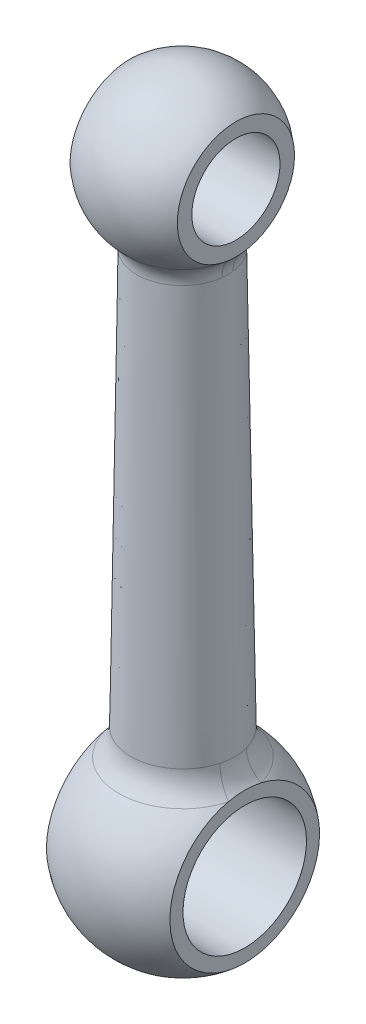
from build123d import *

# Parameters (mm, degrees)
SKETCH2_W          = 2
SKETCH2_H          = 10.451094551
SKETCH2_W_2        = 2.5
SKETCH2_H_2        = 9.038784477
CUT_EXTRUDE1_DEPTH = 5
SKETCH3_R          = 2.5
SKETCH3_R_2        = 3.5
CUT_EXTRUDE2_DEPTH = 5
FILLET2_R          = 1.5
FILLET3_R          = 2


with BuildPart() as part:
    # Sketch1 → Revolve1 (revolve)
    with BuildSketch(Plane.XY):
        with BuildLine():
            Line((0.007237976, -5.499995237), (-0.050007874, 38))
            ThreePointArc((-0.050007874, 38), (-4.345723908, 34.840456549), (-2.609217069, 29.798588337))
            Line((-2.609217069, 29.798588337), (-2.965007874, 4.632356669))
            ThreePointArc((-2.965007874, 4.632356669), (-5.277616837, -1.548147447), (0.007237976, -5.499995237))
        make_face()
    revolve(axis=Axis((0.007237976, -5.499995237, 0), (-0.001315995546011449, 0.9999991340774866, 0)))

    # Sketch2 → Cut-Extrude1 (cut, symmetric)
    with BuildSketch(Plane.XY):
        with Locations((-4, 33.44488295)):
            Rectangle(SKETCH2_W, SKETCH2_H)
        with Locations((-4.75, -0.097481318)):
            Rectangle(SKETCH2_W_2, SKETCH2_H_2)
        with Locations((4.75, -0.097481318)):
            Rectangle(SKETCH2_W_2, SKETCH2_H_2)
        with Locations((4, 33.44488295)):
            Rectangle(SKETCH2_W, SKETCH2_H)
    extrude(amount=CUT_EXTRUDE1_DEPTH, both=True, mode=Mode.SUBTRACT)

    # Sketch3 → Cut-Extrude2 (cut, symmetric)
    with BuildSketch(Plane(origin=(0, 0, 0), x_dir=(0, 0, -1), z_dir=(1, 0, 0))):
        with Locations(Location((0, 33.5, 0), (0, 0, 270))):
            Circle(SKETCH3_R)
        with Locations(Location((0, 0, 0), (0, 0, 270))):
            Circle(SKETCH3_R_2)
    extrude(amount=CUT_EXTRUDE2_DEPTH, both=True, mode=Mode.SUBTRACT)

    # Fillet2
    fillet2_edges = [part.edges().sort_by_distance(p)[0] for p in [
        (2.53077848, 29.805352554, 0),
    ]]
    fillet(fillet2_edges, radius=FILLET2_R)

    # Fillet3
    fillet3_edges = [part.edges().sort_by_distance(p)[0] for p in [
        (2.952805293, 4.640144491, 0),
    ]]
    fillet(fillet3_edges, radius=FILLET3_R)


solid = part.part
